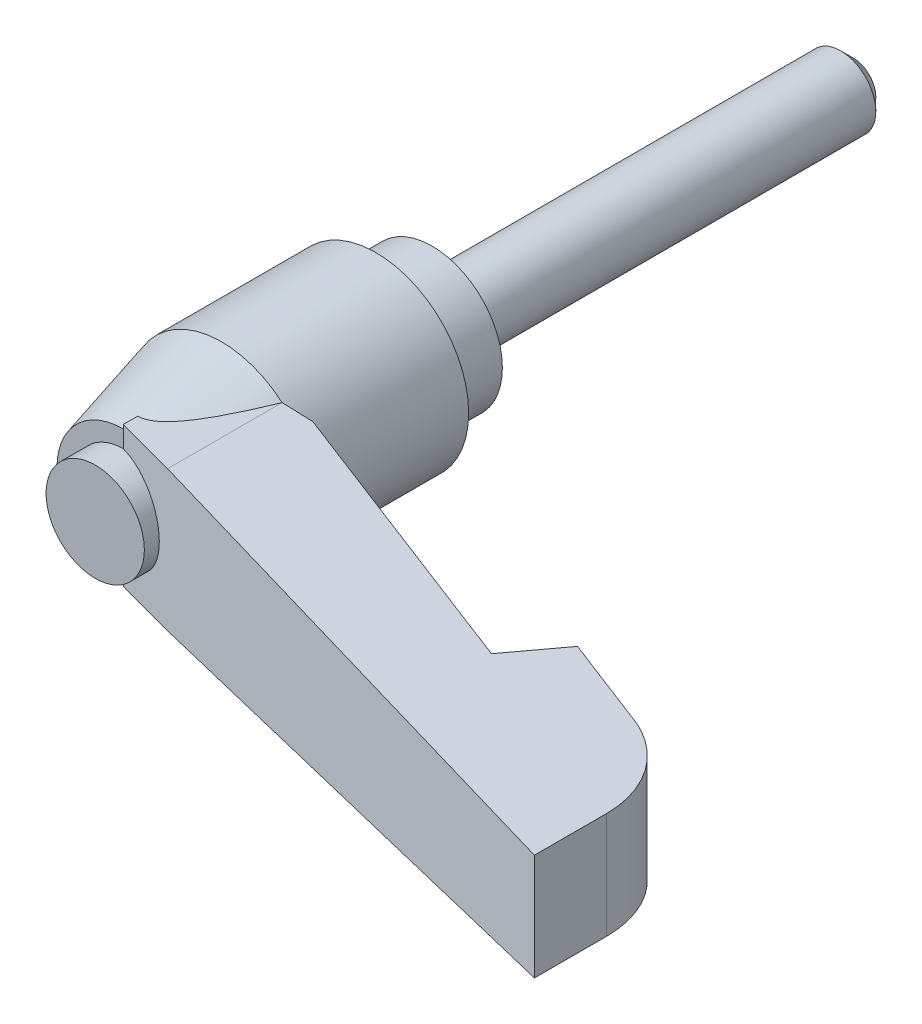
ISO-10303-21;
HEADER;
FILE_DESCRIPTION(('STEP AP214'),'2;1');
FILE_NAME('part.step','',(''),(''),'','','');
FILE_SCHEMA(('AUTOMOTIVE_DESIGN { 1 0 10303 214 1 1 1 1 }'));
ENDSEC;
DATA;
#1=APPLICATION_CONTEXT('core data for automotive mechanical design processes');
#2=APPLICATION_PROTOCOL_DEFINITION('international standard','automotive_design',2000,#1);
#3=PRODUCT_CONTEXT('',#1,'mechanical');
#4=PRODUCT('Part','Part','',(#3));
#5=PRODUCT_RELATED_PRODUCT_CATEGORY('part','',(#4));
#6=PRODUCT_DEFINITION_FORMATION('','',#4);
#7=PRODUCT_DEFINITION_CONTEXT('part definition',#1,'design');
#8=PRODUCT_DEFINITION('design','',#6,#7);
#9=PRODUCT_DEFINITION_SHAPE('','',#8);
#10=(LENGTH_UNIT() NAMED_UNIT(*) SI_UNIT(.MILLI.,.METRE.));
#11=(NAMED_UNIT(*) PLANE_ANGLE_UNIT() SI_UNIT($,.RADIAN.));
#12=(NAMED_UNIT(*) SI_UNIT($,.STERADIAN.) SOLID_ANGLE_UNIT());
#13=UNCERTAINTY_MEASURE_WITH_UNIT(LENGTH_MEASURE(1.E-05),#10,'distance_accuracy_value','');
#14=(GEOMETRIC_REPRESENTATION_CONTEXT(3) GLOBAL_UNCERTAINTY_ASSIGNED_CONTEXT((#13)) GLOBAL_UNIT_ASSIGNED_CONTEXT((#10,
#11,#12)) REPRESENTATION_CONTEXT('',''));
#15=CARTESIAN_POINT('',(0.,0.,0.));
#16=DIRECTION('',(0.,0.,1.));
#17=DIRECTION('',(1.,0.,0.));
#18=AXIS2_PLACEMENT_3D('',#15,#16,#17);
#19=CARTESIAN_POINT('',(2.53,-2.538705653,-30.));
#20=DIRECTION('',(0.,0.,-1.));
#21=DIRECTION('',(-1.,0.,0.));
#22=AXIS2_PLACEMENT_3D('',#19,#20,#21);
#23=PLANE('',#22);
#24=CARTESIAN_POINT('',(0.,0.,-30.));
#25=DIRECTION('',(0.,0.,-1.));
#26=DIRECTION('',(-1.,0.,0.));
#27=AXIS2_PLACEMENT_3D('',#24,#25,#26);
#28=CIRCLE('',#27,1.6);
#29=CARTESIAN_POINT('',(-1.6,0.,-30.));
#30=VERTEX_POINT('',#29);
#31=EDGE_CURVE('E9',#30,#30,#28,.T.);
#32=ORIENTED_EDGE('',*,*,#31,.T.);
#33=EDGE_LOOP('',(#32));
#34=FACE_BOUND('',#33,.T.);
#35=ADVANCED_FACE('F14',(#34),#23,.T.);
#36=CARTESIAN_POINT('',(0.,0.,-30.));
#37=DIRECTION('',(0.,0.,1.));
#38=DIRECTION('',(0.,-1.,0.));
#39=AXIS2_PLACEMENT_3D('',#36,#37,#38);
#40=CYLINDRICAL_SURFACE('',#39,2.5);
#41=CARTESIAN_POINT('',(0.,0.,-29.1));
#42=DIRECTION('',(0.,0.,-1.));
#43=DIRECTION('',(0.,1.,0.));
#44=AXIS2_PLACEMENT_3D('',#41,#42,#43);
#45=CIRCLE('',#44,2.5);
#46=CARTESIAN_POINT('',(0.,2.5,-29.1));
#47=VERTEX_POINT('',#46);
#48=EDGE_CURVE('E23',#47,#47,#45,.F.);
#49=ORIENTED_EDGE('',*,*,#48,.T.);
#50=EDGE_LOOP('',(#49));
#51=FACE_BOUND('',#50,.T.);
#52=CARTESIAN_POINT('',(0.,0.,0.));
#53=DIRECTION('',(0.,0.,1.));
#54=DIRECTION('',(0.,-1.,0.));
#55=AXIS2_PLACEMENT_3D('',#52,#53,#54);
#56=CIRCLE('',#55,2.5);
#57=CARTESIAN_POINT('',(0.,-2.50000000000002,0.));
#58=VERTEX_POINT('',#57);
#59=EDGE_CURVE('E143',#58,#58,#56,.F.);
#60=ORIENTED_EDGE('',*,*,#59,.T.);
#61=EDGE_LOOP('',(#60));
#62=FACE_BOUND('',#61,.T.);
#63=ADVANCED_FACE('F367',(#51,#62),#40,.T.);
#64=CARTESIAN_POINT('',(-5.06,-5.077411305,0.));
#65=DIRECTION('',(0.,0.,1.));
#66=DIRECTION('',(1.,0.,0.));
#67=AXIS2_PLACEMENT_3D('',#64,#65,#66);
#68=PLANE('',#67);
#69=ORIENTED_EDGE('',*,*,#59,.F.);
#70=EDGE_LOOP('',(#69));
#71=FACE_BOUND('',#70,.T.);
#72=CARTESIAN_POINT('',(0.,0.,0.));
#73=DIRECTION('',(0.,0.,1.));
#74=DIRECTION('',(1.,0.,0.));
#75=AXIS2_PLACEMENT_3D('',#72,#73,#74);
#76=CIRCLE('',#75,5.);
#77=CARTESIAN_POINT('',(5.,0.,0.));
#78=VERTEX_POINT('',#77);
#79=EDGE_CURVE('E122',#78,#78,#76,.T.);
#80=ORIENTED_EDGE('',*,*,#79,.F.);
#81=EDGE_LOOP('',(#80));
#82=FACE_BOUND('',#81,.T.);
#83=ADVANCED_FACE('F369',(#71,#82),#68,.F.);
#84=CARTESIAN_POINT('',(-3.542,-3.554187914,24.));
#85=DIRECTION('',(0.,0.,1.));
#86=DIRECTION('',(1.,0.,0.));
#87=AXIS2_PLACEMENT_3D('',#84,#85,#86);
#88=PLANE('',#87);
#89=CARTESIAN_POINT('',(0.,0.,24.));
#90=DIRECTION('',(0.,0.,1.));
#91=DIRECTION('',(1.,0.,0.));
#92=AXIS2_PLACEMENT_3D('',#89,#90,#91);
#93=CIRCLE('',#92,3.5);
#94=CARTESIAN_POINT('',(3.5,0.,24.));
#95=VERTEX_POINT('',#94);
#96=EDGE_CURVE('E208',#95,#95,#93,.F.);
#97=ORIENTED_EDGE('',*,*,#96,.F.);
#98=EDGE_LOOP('',(#97));
#99=FACE_BOUND('',#98,.T.);
#100=ADVANCED_FACE('F365',(#99),#88,.T.);
#101=CARTESIAN_POINT('',(0.,0.,0.));
#102=DIRECTION('',(0.,0.,1.));
#103=DIRECTION('',(1.,0.,0.));
#104=AXIS2_PLACEMENT_3D('',#101,#102,#103);
#105=CYLINDRICAL_SURFACE('',#104,5.);
#106=CARTESIAN_POINT('',(0.,0.,4.));
#107=DIRECTION('',(0.,0.,1.));
#108=DIRECTION('',(1.,0.,0.));
#109=AXIS2_PLACEMENT_3D('',#106,#107,#108);
#110=CIRCLE('',#109,5.);
#111=CARTESIAN_POINT('',(5.,0.,4.));
#112=VERTEX_POINT('',#111);
#113=EDGE_CURVE('E273',#112,#112,#110,.F.);
#114=ORIENTED_EDGE('',*,*,#113,.T.);
#115=EDGE_LOOP('',(#114));
#116=FACE_BOUND('',#115,.T.);
#117=ORIENTED_EDGE('',*,*,#79,.T.);
#118=EDGE_LOOP('',(#117));
#119=FACE_BOUND('',#118,.T.);
#120=ADVANCED_FACE('F362',(#116,#119),#105,.T.);
#121=CARTESIAN_POINT('',(6.5,1.121419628,15.));
#122=DIRECTION('',(0.,0.,-1.));
#123=DIRECTION('',(-1.,0.,0.));
#124=AXIS2_PLACEMENT_3D('',#121,#122,#123);
#125=PLANE('',#124);
#126=DIRECTION('',(-0.999423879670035,0.0339397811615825,0.));
#127=VECTOR('',#126,1.);
#128=CARTESIAN_POINT('',(22.154065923,4.393963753,15.));
#129=LINE('',#128,#127);
#130=CARTESIAN_POINT('',(6.4999999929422,4.9255655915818,15.));
#131=VERTEX_POINT('',#130);
#132=CARTESIAN_POINT('',(4.30813184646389,4.99999999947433,15.0000000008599));
#133=VERTEX_POINT('',#132);
#134=EDGE_CURVE('E206',#131,#133,#129,.T.);
#135=ORIENTED_EDGE('',*,*,#134,.F.);
#136=DIRECTION('',(0.,1.,0.));
#137=VECTOR('',#136,1.);
#138=CARTESIAN_POINT('',(6.5,0.,15.));
#139=LINE('',#138,#137);
#140=CARTESIAN_POINT('',(6.5,1.14455231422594,15.));
#141=VERTEX_POINT('',#140);
#142=EDGE_CURVE('E203',#141,#131,#139,.T.);
#143=ORIENTED_EDGE('',*,*,#142,.F.);
#144=CARTESIAN_POINT('',(0.,0.,15.));
#145=DIRECTION('',(0.,0.,1.));
#146=DIRECTION('',(1.,0.,0.));
#147=AXIS2_PLACEMENT_3D('',#144,#145,#146);
#148=CIRCLE('',#147,6.6);
#149=EDGE_CURVE('E284',#133,#141,#148,.F.);
#150=ORIENTED_EDGE('',*,*,#149,.F.);
#151=EDGE_LOOP('',(#135,#143,#150));
#152=FACE_BOUND('',#151,.T.);
#153=ADVANCED_FACE('F283',(#152),#125,.T.);
#154=CARTESIAN_POINT('',(33.,3.991671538,27.571700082));
#155=DIRECTION('',(0.,-1.,0.));
#156=DIRECTION('',(0.,0.,-1.));
#157=AXIS2_PLACEMENT_3D('',#154,#155,#156);
#158=CYLINDRICAL_SURFACE('',#157,7.);
#159=CARTESIAN_POINT('',(33.,4.02564292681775,27.571700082));
#160=DIRECTION('',(0.0339397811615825,0.999423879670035,0.));
#161=DIRECTION('',(0.999423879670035,-0.0339397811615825,0.));
#162=AXIS2_PLACEMENT_3D('',#159,#160,#161);
#163=ELLIPSE('',#162,7.00403516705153,7.);
#164=CARTESIAN_POINT('',(40.,3.787927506,27.571700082));
#165=VERTEX_POINT('',#164);
#166=CARTESIAN_POINT('',(35.3941410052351,3.94433946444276,20.9938517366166));
#167=VERTEX_POINT('',#166);
#168=EDGE_CURVE('E115',#165,#167,#163,.T.);
#169=ORIENTED_EDGE('',*,*,#168,.F.);
#170=DIRECTION('',(0.,-1.,0.));
#171=VECTOR('',#170,1.);
#172=CARTESIAN_POINT('',(40.,0.,27.571700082));
#173=LINE('',#172,#171);
#174=CARTESIAN_POINT('',(40.,-3.787927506,27.571700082));
#175=VERTEX_POINT('',#174);
#176=EDGE_CURVE('E106',#165,#175,#173,.T.);
#177=ORIENTED_EDGE('',*,*,#176,.T.);
#178=CARTESIAN_POINT('',(33.,-4.02564292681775,27.571700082));
#179=DIRECTION('',(-0.0339397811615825,0.999423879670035,0.));
#180=DIRECTION('',(-0.999423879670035,-0.0339397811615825,0.));
#181=AXIS2_PLACEMENT_3D('',#178,#179,#180);
#182=ELLIPSE('',#181,7.00403516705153,7.);
#183=CARTESIAN_POINT('',(35.3941410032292,-3.94433946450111,20.9938517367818));
#184=VERTEX_POINT('',#183);
#185=EDGE_CURVE('E118',#175,#184,#182,.T.);
#186=ORIENTED_EDGE('',*,*,#185,.T.);
#187=DIRECTION('',(0.,-1.,0.));
#188=VECTOR('',#187,1.);
#189=CARTESIAN_POINT('',(35.394141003,0.,20.993851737));
#190=LINE('',#189,#188);
#191=EDGE_CURVE('E111',#167,#184,#190,.T.);
#192=ORIENTED_EDGE('',*,*,#191,.F.);
#193=EDGE_LOOP('',(#169,#177,#186,#192));
#194=FACE_BOUND('',#193,.T.);
#195=ADVANCED_FACE('F113',(#194),#158,.T.);
#196=CARTESIAN_POINT('',(35.394141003,-4.210603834,20.993851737));
#197=DIRECTION('',(0.342020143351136,0.,-0.939692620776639));
#198=DIRECTION('',(-0.939692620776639,0.,-0.342020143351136));
#199=AXIS2_PLACEMENT_3D('',#196,#197,#198);
#200=PLANE('',#199);
#201=DIRECTION('',(-0.939214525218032,0.0318951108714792,-0.341846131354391));
#202=VECTOR('',#201,1.);
#203=CARTESIAN_POINT('',(35.3941410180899,3.944339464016,20.9938517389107));
#204=LINE('',#203,#202);
#205=CARTESIAN_POINT('',(29.0236925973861,4.16067572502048,18.67519813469));
#206=VERTEX_POINT('',#205);
#207=EDGE_CURVE('E125',#167,#206,#204,.T.);
#208=ORIENTED_EDGE('',*,*,#207,.F.);
#209=ORIENTED_EDGE('',*,*,#191,.T.);
#210=DIRECTION('',(-0.939214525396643,-0.0318951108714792,-0.341846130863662));
#211=VECTOR('',#210,1.);
#212=CARTESIAN_POINT('',(35.3941410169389,-3.944339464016,20.9938517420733));
#213=LINE('',#212,#211);
#214=CARTESIAN_POINT('',(29.023692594,-4.16067572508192,18.675198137));
#215=VERTEX_POINT('',#214);
#216=EDGE_CURVE('E300',#184,#215,#213,.T.);
#217=ORIENTED_EDGE('',*,*,#216,.T.);
#218=DIRECTION('',(0.,-1.,0.));
#219=VECTOR('',#218,1.);
#220=CARTESIAN_POINT('',(29.023692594,0.,18.675198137));
#221=LINE('',#220,#219);
#222=EDGE_CURVE('E121',#206,#215,#221,.T.);
#223=ORIENTED_EDGE('',*,*,#222,.F.);
#224=EDGE_LOOP('',(#208,#209,#217,#223));
#225=FACE_BOUND('',#224,.T.);
#226=ADVANCED_FACE('F126',(#225),#200,.T.);
#227=CARTESIAN_POINT('',(29.023692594,-4.297335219,18.675198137));
#228=DIRECTION('',(-0.819152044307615,0.,-0.57357643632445));
#229=DIRECTION('',(-0.57357643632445,0.,0.819152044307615));
#230=AXIS2_PLACEMENT_3D('',#227,#228,#229);
#231=PLANE('',#230);
#232=DIRECTION('',(-0.573467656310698,0.0194745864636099,0.818996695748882));
#233=VECTOR('',#232,1.);
#234=CARTESIAN_POINT('',(29.0236925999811,4.16067572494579,18.675198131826));
#235=LINE('',#234,#233);
#236=CARTESIAN_POINT('',(26.5000000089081,4.2463786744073,22.2794046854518));
#237=VERTEX_POINT('',#236);
#238=EDGE_CURVE('E131',#206,#237,#235,.T.);
#239=ORIENTED_EDGE('',*,*,#238,.F.);
#240=ORIENTED_EDGE('',*,*,#222,.T.);
#241=DIRECTION('',(-0.573467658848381,-0.0194745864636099,0.818996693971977));
#242=VECTOR('',#241,1.);
#243=CARTESIAN_POINT('',(29.0236925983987,-4.16067572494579,18.675198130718));
#244=LINE('',#243,#242);
#245=CARTESIAN_POINT('',(26.5,-4.24637867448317,22.279404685));
#246=VERTEX_POINT('',#245);
#247=EDGE_CURVE('E302',#215,#246,#244,.T.);
#248=ORIENTED_EDGE('',*,*,#247,.T.);
#249=DIRECTION('',(0.,-1.,0.));
#250=VECTOR('',#249,1.);
#251=CARTESIAN_POINT('',(26.5,0.,22.279404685));
#252=LINE('',#251,#250);
#253=EDGE_CURVE('E200',#237,#246,#252,.T.);
#254=ORIENTED_EDGE('',*,*,#253,.F.);
#255=EDGE_LOOP('',(#239,#240,#248,#254));
#256=FACE_BOUND('',#255,.T.);
#257=ADVANCED_FACE('F507',(#256),#231,.T.);
#258=CARTESIAN_POINT('',(26.5,-4.984672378,22.279404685));
#259=DIRECTION('',(0.342020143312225,0.,-0.939692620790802));
#260=DIRECTION('',(-0.939692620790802,0.,-0.342020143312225));
#261=AXIS2_PLACEMENT_3D('',#258,#259,#260);
#262=PLANE('',#261);
#263=DIRECTION('',(-0.939214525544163,0.0318951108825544,-0.341846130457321));
#264=VECTOR('',#263,1.);
#265=CARTESIAN_POINT('',(26.5000000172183,4.24637867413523,22.2794046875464));
#266=LINE('',#265,#264);
#267=EDGE_CURVE('E209',#237,#131,#266,.T.);
#268=ORIENTED_EDGE('',*,*,#267,.F.);
#269=ORIENTED_EDGE('',*,*,#253,.T.);
#270=DIRECTION('',(-0.939214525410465,-0.0318951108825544,-0.34184613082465));
#271=VECTOR('',#270,1.);
#272=CARTESIAN_POINT('',(26.5000000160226,-4.24637867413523,22.2794046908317));
#273=LINE('',#272,#271);
#274=CARTESIAN_POINT('',(6.5,-4.92556559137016,15.));
#275=VERTEX_POINT('',#274);
#276=EDGE_CURVE('E172',#246,#275,#273,.T.);
#277=ORIENTED_EDGE('',*,*,#276,.T.);
#278=DIRECTION('',(0.,-1.,0.));
#279=VECTOR('',#278,1.);
#280=CARTESIAN_POINT('',(6.5,-3.072276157,15.));
#281=LINE('',#280,#279);
#282=CARTESIAN_POINT('',(6.50000000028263,-1.1445523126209,15.));
#283=VERTEX_POINT('',#282);
#284=EDGE_CURVE('E265',#283,#275,#281,.T.);
#285=ORIENTED_EDGE('',*,*,#284,.F.);
#286=CARTESIAN_POINT('',(-0.712266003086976,0.,12.3749498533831));
#287=DIRECTION('',(0.342020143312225,0.,-0.939692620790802));
#288=DIRECTION('',(-0.939692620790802,0.,-0.342020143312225));
#289=AXIS2_PLACEMENT_3D('',#286,#287,#288);
#290=ELLIPSE('',#289,7.77209472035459,7.26856501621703);
#291=CARTESIAN_POINT('',(6.59542722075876,-3.94812923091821E-10,15.0145038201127));
#292=VERTEX_POINT('',#291);
#293=EDGE_CURVE('E31',#292,#283,#290,.T.);
#294=ORIENTED_EDGE('',*,*,#293,.F.);
#295=CARTESIAN_POINT('',(0.,0.,12.634193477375));
#296=DIRECTION('',(0.342020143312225,0.,-0.939692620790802));
#297=DIRECTION('',(0.939692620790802,0.,0.342020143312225));
#298=AXIS2_PLACEMENT_3D('',#295,#296,#297);
#299=ELLIPSE('',#298,7.02357329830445,6.6);
#300=EDGE_CURVE('E279',#141,#292,#299,.T.);
#301=ORIENTED_EDGE('',*,*,#300,.F.);
#302=ORIENTED_EDGE('',*,*,#142,.T.);
#303=EDGE_LOOP('',(#268,#269,#277,#285,#294,#301,#302));
#304=FACE_BOUND('',#303,.T.);
#305=ADVANCED_FACE('F277',(#304),#262,.T.);
#306=CARTESIAN_POINT('',(40.,-3.787927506,27.571700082));
#307=DIRECTION('',(-1.,0.,0.));
#308=DIRECTION('',(0.,0.,1.));
#309=AXIS2_PLACEMENT_3D('',#306,#307,#308);
#310=PLANE('',#309);
#311=DIRECTION('',(0.,0.,-1.));
#312=VECTOR('',#311,1.);
#313=CARTESIAN_POINT('',(40.,-3.787927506,23.9121377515));
#314=LINE('',#313,#312);
#315=CARTESIAN_POINT('',(40.,-3.787927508,32.717967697));
#316=VERTEX_POINT('',#315);
#317=EDGE_CURVE('E263',#316,#175,#314,.T.);
#318=ORIENTED_EDGE('',*,*,#317,.T.);
#319=ORIENTED_EDGE('',*,*,#176,.F.);
#320=DIRECTION('',(0.,0.,-1.));
#321=VECTOR('',#320,1.);
#322=CARTESIAN_POINT('',(40.,3.787927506,23.9121377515));
#323=LINE('',#322,#321);
#324=CARTESIAN_POINT('',(40.,3.787927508,32.717967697));
#325=VERTEX_POINT('',#324);
#326=EDGE_CURVE('E136',#325,#165,#323,.T.);
#327=ORIENTED_EDGE('',*,*,#326,.F.);
#328=DIRECTION('',(0.,1.,0.));
#329=VECTOR('',#328,1.);
#330=CARTESIAN_POINT('',(40.,0.,32.717967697));
#331=LINE('',#330,#329);
#332=EDGE_CURVE('E197',#316,#325,#331,.T.);
#333=ORIENTED_EDGE('',*,*,#332,.F.);
#334=EDGE_LOOP('',(#318,#319,#327,#333));
#335=FACE_BOUND('',#334,.T.);
#336=ADVANCED_FACE('F525',(#335),#310,.F.);
#337=CARTESIAN_POINT('',(40.,3.787927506,15.));
#338=DIRECTION('',(0.0339397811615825,0.999423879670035,0.));
#339=DIRECTION('',(-0.999423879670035,0.0339397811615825,0.));
#340=AXIS2_PLACEMENT_3D('',#337,#338,#339);
#341=PLANE('',#340);
#342=ORIENTED_EDGE('',*,*,#267,.T.);
#343=ORIENTED_EDGE('',*,*,#134,.T.);
#344=DIRECTION('',(0.,0.,1.));
#345=VECTOR('',#344,1.);
#346=CARTESIAN_POINT('',(4.308131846,5.,19.0771802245));
#347=LINE('',#346,#345);
#348=CARTESIAN_POINT('',(4.30813184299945,5.,23.1543604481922));
#349=VERTEX_POINT('',#348);
#350=EDGE_CURVE('E272',#133,#349,#347,.T.);
#351=ORIENTED_EDGE('',*,*,#350,.T.);
#352=DIRECTION('',(-0.965406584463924,0.0327845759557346,-0.258679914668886));
#353=VECTOR('',#352,1.);
#354=CARTESIAN_POINT('',(40.,3.78792751,32.717967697));
#355=LINE('',#354,#353);
#356=EDGE_CURVE('E194',#325,#349,#355,.T.);
#357=ORIENTED_EDGE('',*,*,#356,.F.);
#358=ORIENTED_EDGE('',*,*,#326,.T.);
#359=ORIENTED_EDGE('',*,*,#168,.T.);
#360=ORIENTED_EDGE('',*,*,#207,.T.);
#361=ORIENTED_EDGE('',*,*,#238,.T.);
#362=EDGE_LOOP('',(#342,#343,#351,#357,#358,#359,#360,#361));
#363=FACE_BOUND('',#362,.T.);
#364=ADVANCED_FACE('F134',(#363),#341,.T.);
#365=CARTESIAN_POINT('',(0.,0.,22.));
#366=DIRECTION('',(0.,0.,1.));
#367=DIRECTION('',(1.,0.,0.));
#368=AXIS2_PLACEMENT_3D('',#365,#366,#367);
#369=CYLINDRICAL_SURFACE('',#368,3.5);
#370=CARTESIAN_POINT('',(0.,0.,22.));
#371=DIRECTION('',(-0.258819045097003,0.,0.965925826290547));
#372=DIRECTION('',(0.965925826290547,0.,0.258819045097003));
#373=AXIS2_PLACEMENT_3D('',#370,#371,#372);
#374=ELLIPSE('',#373,3.62346663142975,3.5);
#375=CARTESIAN_POINT('',(0.,3.5,22.));
#376=VERTEX_POINT('',#375);
#377=CARTESIAN_POINT('',(0.,-3.5,22.));
#378=VERTEX_POINT('',#377);
#379=EDGE_CURVE('E188',#376,#378,#374,.F.);
#380=ORIENTED_EDGE('',*,*,#379,.F.);
#381=CARTESIAN_POINT('',(0.,0.,22.));
#382=DIRECTION('',(0.,0.,1.));
#383=DIRECTION('',(1.,0.,0.));
#384=AXIS2_PLACEMENT_3D('',#381,#382,#383);
#385=CIRCLE('',#384,3.5);
#386=EDGE_CURVE('E254',#376,#378,#385,.T.);
#387=ORIENTED_EDGE('',*,*,#386,.T.);
#388=EDGE_LOOP('',(#380,#387));
#389=FACE_BOUND('',#388,.T.);
#390=ORIENTED_EDGE('',*,*,#96,.T.);
#391=EDGE_LOOP('',(#390));
#392=FACE_BOUND('',#391,.T.);
#393=ADVANCED_FACE('F356',(#389,#392),#369,.T.);
#394=CARTESIAN_POINT('',(0.,4.722701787,20.96510898));
#395=DIRECTION('',(-1.,0.,0.));
#396=DIRECTION('',(0.,0.,1.));
#397=AXIS2_PLACEMENT_3D('',#394,#395,#396);
#398=PLANE('',#397);
#399=DIRECTION('',(0.,-1.,0.));
#400=VECTOR('',#399,1.);
#401=CARTESIAN_POINT('',(0.,0.,22.));
#402=LINE('',#401,#400);
#403=CARTESIAN_POINT('',(0.,5.,22.00000000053));
#404=VERTEX_POINT('',#403);
#405=CARTESIAN_POINT('',(4.8449077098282E-10,4.7243556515,22.));
#406=VERTEX_POINT('',#405);
#407=EDGE_CURVE('E185',#404,#406,#402,.T.);
#408=ORIENTED_EDGE('',*,*,#407,.F.);
#409=DIRECTION('',(0.,0.,-1.));
#410=VECTOR('',#409,1.);
#411=CARTESIAN_POINT('',(0.,5.,19.0771802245));
#412=LINE('',#411,#410);
#413=CARTESIAN_POINT('',(2.56379285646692E-10,5.,20.9712812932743));
#414=VERTEX_POINT('',#413);
#415=EDGE_CURVE('E270',#404,#414,#412,.T.);
#416=ORIENTED_EDGE('',*,*,#415,.T.);
#417=DIRECTION('',(5.3084673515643E-11,0.258819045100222,-0.965925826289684));
#418=VECTOR('',#417,1.);
#419=CARTESIAN_POINT('',(1.16133208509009E-09,5.6621778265,18.5));
#420=LINE('',#419,#418);
#421=EDGE_CURVE('E180',#406,#414,#420,.T.);
#422=ORIENTED_EDGE('',*,*,#421,.F.);
#423=EDGE_LOOP('',(#408,#416,#422));
#424=FACE_BOUND('',#423,.T.);
#425=ADVANCED_FACE('F323',(#424),#398,.T.);
#426=CARTESIAN_POINT('',(0.,5.,23.203286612));
#427=DIRECTION('',(0.,-1.,0.));
#428=DIRECTION('',(0.,0.,-1.));
#429=AXIS2_PLACEMENT_3D('',#426,#427,#428);
#430=PLANE('',#429);
#431=ORIENTED_EDGE('',*,*,#350,.F.);
#432=CARTESIAN_POINT('',(5.12758570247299E-10,4.99999999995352,20.9712812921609));
#433=CARTESIAN_POINT('',(0.0452169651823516,4.99999999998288,20.9713050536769));
#434=CARTESIAN_POINT('',(0.0904012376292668,4.99999999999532,20.9689904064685));
#435=CARTESIAN_POINT('',(0.180236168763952,5.00000000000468,20.9599070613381));
#436=CARTESIAN_POINT('',(0.224887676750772,5.00000000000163,20.9531468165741));
#437=CARTESIAN_POINT('',(0.355879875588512,4.9999999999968,20.9268621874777));
#438=CARTESIAN_POINT('',(0.441043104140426,4.99999999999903,20.9013147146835));
#439=CARTESIAN_POINT('',(0.632227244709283,5.00000000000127,20.8270446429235));
#440=CARTESIAN_POINT('',(0.736330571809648,5.00000000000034,20.7735488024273));
#441=CARTESIAN_POINT('',(0.935669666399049,4.99999999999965,20.6509465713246));
#442=CARTESIAN_POINT('',(1.03082413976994,4.9999999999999,20.5817135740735));
#443=CARTESIAN_POINT('',(1.23366330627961,5.00000000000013,20.4160087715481));
#444=CARTESIAN_POINT('',(1.33918187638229,5.00000000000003,20.3169366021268));
#445=CARTESIAN_POINT('',(1.54038525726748,4.99999999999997,20.1091453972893));
#446=CARTESIAN_POINT('',(1.63605047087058,4.99999999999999,20.0004079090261));
#447=CARTESIAN_POINT('',(1.82048892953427,5.00000000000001,19.7755785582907));
#448=CARTESIAN_POINT('',(1.9091882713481,5.,19.6594267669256));
#449=CARTESIAN_POINT('',(2.08029219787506,5.,19.4227906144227));
#450=CARTESIAN_POINT('',(2.16270259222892,5.,19.302310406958));
#451=CARTESIAN_POINT('',(2.35274250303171,5.,19.0120714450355));
#452=CARTESIAN_POINT('',(2.4581571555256,5.,18.8408691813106));
#453=CARTESIAN_POINT('',(2.66191601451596,5.,18.494284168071));
#454=CARTESIAN_POINT('',(2.76025796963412,5.,18.3189001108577));
#455=CARTESIAN_POINT('',(2.95155424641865,5.,17.9648132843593));
#456=CARTESIAN_POINT('',(3.04449826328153,5.,17.7861049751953));
#457=CARTESIAN_POINT('',(3.22591068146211,5.,17.4264286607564));
#458=CARTESIAN_POINT('',(3.31437881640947,5.,17.2454605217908));
#459=CARTESIAN_POINT('',(3.48198701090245,5.,16.8936485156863));
#460=CARTESIAN_POINT('',(3.56135902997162,5.,16.7229147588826));
#461=CARTESIAN_POINT('',(3.71739787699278,5.,16.3802085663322));
#462=CARTESIAN_POINT('',(3.79406458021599,5.,16.2082360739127));
#463=CARTESIAN_POINT('',(3.94476452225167,5.,15.8640185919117));
#464=CARTESIAN_POINT('',(4.01880761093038,5.,15.6917779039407));
#465=CARTESIAN_POINT('',(4.16489312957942,5.,15.3464724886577));
#466=CARTESIAN_POINT('',(4.23693578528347,5.,15.1734078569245));
#467=CARTESIAN_POINT('',(4.3081318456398,5.,15.0000000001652));
#468=B_SPLINE_CURVE_WITH_KNOTS('',3,(#432,#433,#434,#435,#436,#437,#438,#439,#440,#441,#442,
#443,#444,#445,#446,#447,#448,#449,#450,#451,#452,#453,#454,#455,#456,#457,#458,#459,#460,#461,
#462,#463,#464,#465,#466,#467),.UNSPECIFIED.,.F.,.F.,(4,2,2,2,2,2,2,2,2,2,2,2,2,2,2,2,2,4),(0.,
0.135533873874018,0.270810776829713,0.536101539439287,0.885260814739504,1.23733529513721,
1.67054898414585,2.10460829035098,2.54278097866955,2.98054386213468,3.58345671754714,
4.18656065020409,4.79078044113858,5.39503614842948,5.95985360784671,6.52469707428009,
7.08712785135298,7.6494949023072),.UNSPECIFIED.);
#469=EDGE_CURVE('E183',#414,#133,#468,.T.);
#470=ORIENTED_EDGE('',*,*,#469,.F.);
#471=ORIENTED_EDGE('',*,*,#415,.F.);
#472=DIRECTION('',(-0.965925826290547,0.,-0.258819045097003));
#473=VECTOR('',#472,1.);
#474=CARTESIAN_POINT('',(20.,5.,27.3589838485));
#475=LINE('',#474,#473);
#476=EDGE_CURVE('E189',#349,#404,#475,.T.);
#477=ORIENTED_EDGE('',*,*,#476,.F.);
#478=EDGE_LOOP('',(#431,#470,#471,#477));
#479=FACE_BOUND('',#478,.T.);
#480=ADVANCED_FACE('F317',(#479),#430,.F.);
#481=CARTESIAN_POINT('',(-6.6792,-6.702182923,4.));
#482=DIRECTION('',(0.,0.,1.));
#483=DIRECTION('',(1.,0.,0.));
#484=AXIS2_PLACEMENT_3D('',#481,#482,#483);
#485=PLANE('',#484);
#486=ORIENTED_EDGE('',*,*,#113,.F.);
#487=EDGE_LOOP('',(#486));
#488=FACE_BOUND('',#487,.T.);
#489=CARTESIAN_POINT('',(0.,0.,4.));
#490=DIRECTION('',(0.,0.,1.));
#491=DIRECTION('',(1.,0.,0.));
#492=AXIS2_PLACEMENT_3D('',#489,#490,#491);
#493=CIRCLE('',#492,6.6);
#494=CARTESIAN_POINT('',(6.6,0.,4.));
#495=VERTEX_POINT('',#494);
#496=EDGE_CURVE('E177',#495,#495,#493,.T.);
#497=ORIENTED_EDGE('',*,*,#496,.F.);
#498=EDGE_LOOP('',(#497));
#499=FACE_BOUND('',#498,.T.);
#500=ADVANCED_FACE('F322',(#488,#499),#485,.F.);
#501=CARTESIAN_POINT('',(0.,0.,15.022195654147));
#502=DIRECTION('',(0.,0.,-1.));
#503=DIRECTION('',(-1.,0.,0.));
#504=AXIS2_PLACEMENT_3D('',#501,#502,#503);
#505=CONICAL_SURFACE('',#504,6.594052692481,0.261799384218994);
#506=CARTESIAN_POINT('',(0.,0.,15.));
#507=DIRECTION('',(0.,0.,1.));
#508=DIRECTION('',(1.,0.,0.));
#509=AXIS2_PLACEMENT_3D('',#506,#507,#508);
#510=CIRCLE('',#509,6.6);
#511=EDGE_CURVE('E173',#292,#283,#510,.F.);
#512=ORIENTED_EDGE('',*,*,#511,.F.);
#513=ORIENTED_EDGE('',*,*,#293,.T.);
#514=EDGE_LOOP('',(#512,#513));
#515=FACE_BOUND('',#514,.T.);
#516=ADVANCED_FACE('F328',(#515),#505,.T.);
#517=CARTESIAN_POINT('',(6.5,-5.023132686,15.));
#518=DIRECTION('',(0.,0.,-1.));
#519=DIRECTION('',(-1.,0.,0.));
#520=AXIS2_PLACEMENT_3D('',#517,#518,#519);
#521=PLANE('',#520);
#522=CARTESIAN_POINT('',(0.,0.,15.));
#523=DIRECTION('',(0.,0.,1.));
#524=DIRECTION('',(1.,0.,0.));
#525=AXIS2_PLACEMENT_3D('',#522,#523,#524);
#526=CIRCLE('',#525,6.6);
#527=CARTESIAN_POINT('',(4.30813184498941,-5.00000000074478,14.9999999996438));
#528=VERTEX_POINT('',#527);
#529=EDGE_CURVE('E176',#283,#528,#526,.F.);
#530=ORIENTED_EDGE('',*,*,#529,.F.);
#531=ORIENTED_EDGE('',*,*,#284,.T.);
#532=DIRECTION('',(-0.999423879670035,-0.0339397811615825,0.));
#533=VECTOR('',#532,1.);
#534=CARTESIAN_POINT('',(22.154065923,-4.393963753,15.));
#535=LINE('',#534,#533);
#536=EDGE_CURVE('E169',#275,#528,#535,.T.);
#537=ORIENTED_EDGE('',*,*,#536,.T.);
#538=EDGE_LOOP('',(#530,#531,#537));
#539=FACE_BOUND('',#538,.T.);
#540=ADVANCED_FACE('F330',(#539),#521,.T.);
#541=CARTESIAN_POINT('',(40.,-3.787927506,15.));
#542=DIRECTION('',(-0.0339397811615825,0.999423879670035,0.));
#543=DIRECTION('',(-0.999423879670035,-0.0339397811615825,0.));
#544=AXIS2_PLACEMENT_3D('',#541,#542,#543);
#545=PLANE('',#544);
#546=DIRECTION('',(0.,0.,1.));
#547=VECTOR('',#546,1.);
#548=CARTESIAN_POINT('',(4.308131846,-5.,19.0771802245));
#549=LINE('',#548,#547);
#550=CARTESIAN_POINT('',(4.30813184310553,-4.99999999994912,23.1543604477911));
#551=VERTEX_POINT('',#550);
#552=EDGE_CURVE('E244',#528,#551,#549,.T.);
#553=ORIENTED_EDGE('',*,*,#552,.F.);
#554=ORIENTED_EDGE('',*,*,#536,.F.);
#555=ORIENTED_EDGE('',*,*,#276,.F.);
#556=ORIENTED_EDGE('',*,*,#247,.F.);
#557=ORIENTED_EDGE('',*,*,#216,.F.);
#558=ORIENTED_EDGE('',*,*,#185,.F.);
#559=ORIENTED_EDGE('',*,*,#317,.F.);
#560=DIRECTION('',(0.965406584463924,0.0327845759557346,0.258679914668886));
#561=VECTOR('',#560,1.);
#562=CARTESIAN_POINT('',(4.30813184,-5.,23.1543604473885));
#563=LINE('',#562,#561);
#564=EDGE_CURVE('E171',#551,#316,#563,.T.);
#565=ORIENTED_EDGE('',*,*,#564,.F.);
#566=EDGE_LOOP('',(#553,#554,#555,#556,#557,#558,#559,#565));
#567=FACE_BOUND('',#566,.T.);
#568=ADVANCED_FACE('F333',(#567),#545,.F.);
#569=CARTESIAN_POINT('',(0.,-5.,22.));
#570=DIRECTION('',(-0.258819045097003,0.,0.965925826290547));
#571=DIRECTION('',(0.965925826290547,0.,0.258819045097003));
#572=AXIS2_PLACEMENT_3D('',#569,#570,#571);
#573=PLANE('',#572);
#574=DIRECTION('',(0.,1.,0.));
#575=VECTOR('',#574,1.);
#576=CARTESIAN_POINT('',(0.,-4.8613508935,22.));
#577=LINE('',#576,#575);
#578=CARTESIAN_POINT('',(0.,-5.,22.0000000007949));
#579=VERTEX_POINT('',#578);
#580=CARTESIAN_POINT('',(9.0870570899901E-10,-4.72435565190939,22.));
#581=VERTEX_POINT('',#580);
#582=EDGE_CURVE('E164',#579,#581,#577,.T.);
#583=ORIENTED_EDGE('',*,*,#582,.F.);
#584=DIRECTION('',(-0.965925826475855,0.,-0.258819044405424));
#585=VECTOR('',#584,1.);
#586=CARTESIAN_POINT('',(4.308131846,-5.,23.1543604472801));
#587=LINE('',#586,#585);
#588=EDGE_CURVE('E165',#551,#579,#587,.T.);
#589=ORIENTED_EDGE('',*,*,#588,.F.);
#590=ORIENTED_EDGE('',*,*,#564,.T.);
#591=ORIENTED_EDGE('',*,*,#332,.T.);
#592=ORIENTED_EDGE('',*,*,#356,.T.);
#593=ORIENTED_EDGE('',*,*,#476,.T.);
#594=ORIENTED_EDGE('',*,*,#407,.T.);
#595=DIRECTION('',(0.,-1.,0.));
#596=VECTOR('',#595,1.);
#597=CARTESIAN_POINT('',(0.,0.,22.));
#598=LINE('',#597,#596);
#599=EDGE_CURVE('E257',#406,#376,#598,.T.);
#600=ORIENTED_EDGE('',*,*,#599,.T.);
#601=ORIENTED_EDGE('',*,*,#379,.T.);
#602=DIRECTION('',(0.,-1.,0.));
#603=VECTOR('',#602,1.);
#604=CARTESIAN_POINT('',(0.,0.,22.));
#605=LINE('',#604,#603);
#606=EDGE_CURVE('E184',#378,#581,#605,.T.);
#607=ORIENTED_EDGE('',*,*,#606,.T.);
#608=EDGE_LOOP('',(#583,#589,#590,#591,#592,#593,#594,#600,#601,#607));
#609=FACE_BOUND('',#608,.T.);
#610=ADVANCED_FACE('F247',(#609),#573,.T.);
#611=CARTESIAN_POINT('',(0.,-4.781047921,22.));
#612=DIRECTION('',(0.,0.,-1.));
#613=DIRECTION('',(-1.,0.,0.));
#614=AXIS2_PLACEMENT_3D('',#611,#612,#613);
#615=PLANE('',#614);
#616=CARTESIAN_POINT('',(0.,0.,22.));
#617=DIRECTION('',(0.,0.,-1.));
#618=DIRECTION('',(-1.,0.,0.));
#619=AXIS2_PLACEMENT_3D('',#616,#617,#618);
#620=CIRCLE('',#619,4.724355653);
#621=EDGE_CURVE('E168',#581,#406,#620,.T.);
#622=ORIENTED_EDGE('',*,*,#621,.F.);
#623=ORIENTED_EDGE('',*,*,#606,.F.);
#624=ORIENTED_EDGE('',*,*,#386,.F.);
#625=ORIENTED_EDGE('',*,*,#599,.F.);
#626=EDGE_LOOP('',(#622,#623,#624,#625));
#627=FACE_BOUND('',#626,.T.);
#628=ADVANCED_FACE('F229',(#627),#615,.F.);
#629=CARTESIAN_POINT('',(0.,0.,4.));
#630=DIRECTION('',(0.,0.,1.));
#631=DIRECTION('',(1.,0.,0.));
#632=AXIS2_PLACEMENT_3D('',#629,#630,#631);
#633=CYLINDRICAL_SURFACE('',#632,6.6);
#634=ORIENTED_EDGE('',*,*,#496,.T.);
#635=EDGE_LOOP('',(#634));
#636=FACE_BOUND('',#635,.T.);
#637=ORIENTED_EDGE('',*,*,#529,.T.);
#638=CARTESIAN_POINT('',(0.,0.,15.));
#639=DIRECTION('',(0.,0.,-1.));
#640=DIRECTION('',(-1.,0.,0.));
#641=AXIS2_PLACEMENT_3D('',#638,#639,#640);
#642=CIRCLE('',#641,6.6);
#643=EDGE_CURVE('E155',#133,#528,#642,.F.);
#644=ORIENTED_EDGE('',*,*,#643,.F.);
#645=ORIENTED_EDGE('',*,*,#149,.T.);
#646=ORIENTED_EDGE('',*,*,#300,.T.);
#647=ORIENTED_EDGE('',*,*,#511,.T.);
#648=EDGE_LOOP('',(#637,#644,#645,#646,#647));
#649=FACE_BOUND('',#648,.T.);
#650=ADVANCED_FACE('F227',(#636,#649),#633,.T.);
#651=CARTESIAN_POINT('',(0.,-5.,23.203286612));
#652=DIRECTION('',(0.,-1.,0.));
#653=DIRECTION('',(0.,0.,-1.));
#654=AXIS2_PLACEMENT_3D('',#651,#652,#653);
#655=PLANE('',#654);
#656=DIRECTION('',(0.,0.,1.));
#657=VECTOR('',#656,1.);
#658=CARTESIAN_POINT('',(0.,-5.,21.48255449));
#659=LINE('',#658,#657);
#660=CARTESIAN_POINT('',(9.61724492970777E-10,-5.,20.9712812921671));
#661=VERTEX_POINT('',#660);
#662=EDGE_CURVE('E161',#661,#579,#659,.T.);
#663=ORIENTED_EDGE('',*,*,#662,.F.);
#664=CARTESIAN_POINT('',(4.30813184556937,-4.99999999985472,15.0000000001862));
#665=CARTESIAN_POINT('',(4.22695317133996,-4.99999999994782,15.1977035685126));
#666=CARTESIAN_POINT('',(4.14468257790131,-4.99999999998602,15.3949657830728));
#667=CARTESIAN_POINT('',(3.97748181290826,-5.00000000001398,15.788403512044));
#668=CARTESIAN_POINT('',(3.89255113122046,-5.00000000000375,15.9845788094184));
#669=CARTESIAN_POINT('',(3.71969315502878,-4.99999999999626,16.3753187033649));
#670=CARTESIAN_POINT('',(3.63176972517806,-4.99999999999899,16.5698850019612));
#671=CARTESIAN_POINT('',(3.45219836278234,-5.00000000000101,16.9572716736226));
#672=CARTESIAN_POINT('',(3.36055072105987,-5.0000000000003,17.1500921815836));
#673=CARTESIAN_POINT('',(3.1396904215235,-4.99999999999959,17.6009656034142));
#674=CARTESIAN_POINT('',(3.00860107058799,-4.99999999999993,17.8581134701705));
#675=CARTESIAN_POINT('',(2.80337635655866,-5.00000000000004,18.23954911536));
#676=CARTESIAN_POINT('',(2.73346011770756,-5.00000000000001,18.3661077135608));
#677=CARTESIAN_POINT('',(2.59024232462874,-4.99999999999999,18.6172895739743));
#678=CARTESIAN_POINT('',(2.51694106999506,-5.,18.7419130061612));
#679=CARTESIAN_POINT('',(2.36662462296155,-5.,18.98807422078));
#680=CARTESIAN_POINT('',(2.28962938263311,-5.,19.1096241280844));
#681=CARTESIAN_POINT('',(2.1306979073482,-5.,19.3494323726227));
#682=CARTESIAN_POINT('',(2.04876288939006,-5.,19.4676915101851));
#683=CARTESIAN_POINT('',(1.87890565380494,-5.,19.6994333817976));
#684=CARTESIAN_POINT('',(1.79099818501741,-5.,19.8129268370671));
#685=CARTESIAN_POINT('',(1.60741923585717,-5.,20.0333897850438));
#686=CARTESIAN_POINT('',(1.51175533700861,-5.,20.1403654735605));
#687=CARTESIAN_POINT('',(1.32832695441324,-5.,20.3262886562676));
#688=CARTESIAN_POINT('',(1.24219801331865,-5.,20.4068316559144));
#689=CARTESIAN_POINT('',(1.06151972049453,-5.,20.5582115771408));
#690=CARTESIAN_POINT('',(0.966967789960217,-5.,20.6290455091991));
#691=CARTESIAN_POINT('',(0.785708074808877,-5.,20.7446890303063));
#692=CARTESIAN_POINT('',(0.700550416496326,-5.,20.7918848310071));
#693=CARTESIAN_POINT('',(0.523922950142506,-5.,20.8719390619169));
#694=CARTESIAN_POINT('',(0.432483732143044,-5.,20.904861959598));
#695=CARTESIAN_POINT('',(0.283565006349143,-5.,20.9424237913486));
#696=CARTESIAN_POINT('',(0.227601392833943,-5.,20.9531268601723));
#697=CARTESIAN_POINT('',(0.114454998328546,-5.,20.9676092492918));
#698=CARTESIAN_POINT('',(0.0572669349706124,-5.,20.9713468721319));
#699=CARTESIAN_POINT('',(9.62542482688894E-10,-5.,20.9712812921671));
#700=B_SPLINE_CURVE_WITH_KNOTS('',3,(#664,#665,#666,#667,#668,#669,#670,#671,#672,#673,#674,
#675,#676,#677,#678,#679,#680,#681,#682,#683,#684,#685,#686,#687,#688,#689,#690,#691,#692,#693,
#694,#695,#696,#697,#698,#699),.UNSPECIFIED.,.F.,.F.,(4,2,2,2,2,2,2,2,2,2,2,2,2,2,2,2,2,4),(0.,
0.641169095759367,1.28246191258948,1.92295587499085,2.56339991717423,3.42905863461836,
3.86277961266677,4.29646227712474,4.72802050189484,5.15947283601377,5.58989593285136,
6.0199032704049,6.3731949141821,6.72659509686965,7.01777107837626,7.30761782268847,
7.478145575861,7.64969092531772),.UNSPECIFIED.);
#701=EDGE_CURVE('E150',#528,#661,#700,.T.);
#702=ORIENTED_EDGE('',*,*,#701,.F.);
#703=ORIENTED_EDGE('',*,*,#552,.T.);
#704=ORIENTED_EDGE('',*,*,#588,.T.);
#705=EDGE_LOOP('',(#663,#702,#703,#704));
#706=FACE_BOUND('',#705,.T.);
#707=ADVANCED_FACE('F222',(#706),#655,.T.);
#708=CARTESIAN_POINT('',(0.,-5.,20.96510898));
#709=DIRECTION('',(-1.,0.,0.));
#710=DIRECTION('',(0.,0.,1.));
#711=AXIS2_PLACEMENT_3D('',#708,#709,#710);
#712=PLANE('',#711);
#713=ORIENTED_EDGE('',*,*,#662,.T.);
#714=ORIENTED_EDGE('',*,*,#582,.T.);
#715=DIRECTION('',(-9.95650459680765E-11,0.258819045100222,0.965925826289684));
#716=VECTOR('',#715,1.);
#717=CARTESIAN_POINT('',(2.17818203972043E-09,-5.6621778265,18.5));
#718=LINE('',#717,#716);
#719=EDGE_CURVE('E146',#661,#581,#718,.T.);
#720=ORIENTED_EDGE('',*,*,#719,.F.);
#721=EDGE_LOOP('',(#713,#714,#720));
#722=FACE_BOUND('',#721,.T.);
#723=ADVANCED_FACE('F226',(#722),#712,.T.);
#724=CARTESIAN_POINT('',(0.,0.,22.));
#725=DIRECTION('',(0.,0.,-1.));
#726=DIRECTION('',(-1.,0.,0.));
#727=AXIS2_PLACEMENT_3D('',#724,#725,#726);
#728=CONICAL_SURFACE('',#727,4.724355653,0.261799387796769);
#729=ORIENTED_EDGE('',*,*,#701,.T.);
#730=ORIENTED_EDGE('',*,*,#719,.T.);
#731=ORIENTED_EDGE('',*,*,#621,.T.);
#732=ORIENTED_EDGE('',*,*,#421,.T.);
#733=ORIENTED_EDGE('',*,*,#469,.T.);
#734=ORIENTED_EDGE('',*,*,#643,.T.);
#735=EDGE_LOOP('',(#729,#730,#731,#732,#733,#734));
#736=FACE_BOUND('',#735,.T.);
#737=ADVANCED_FACE('F218',(#736),#728,.T.);
#738=CARTESIAN_POINT('',(0.,0.,-29.1));
#739=DIRECTION('',(0.,0.,1.));
#740=DIRECTION('',(0.,-1.,0.));
#741=AXIS2_PLACEMENT_3D('',#738,#739,#740);
#742=CONICAL_SURFACE('',#741,2.5,0.78539816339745);
#743=ORIENTED_EDGE('',*,*,#31,.F.);
#744=EDGE_LOOP('',(#743));
#745=FACE_BOUND('',#744,.T.);
#746=ORIENTED_EDGE('',*,*,#48,.F.);
#747=EDGE_LOOP('',(#746));
#748=FACE_BOUND('',#747,.T.);
#749=ADVANCED_FACE('F16',(#745,#748),#742,.T.);
#750=CLOSED_SHELL('',(#35,#63,#83,#100,#120,#153,#195,#226,#257,#305,#336,#364,#393,#425,#480,
#500,#516,#540,#568,#610,#628,#650,#707,#723,#737,#749));
#751=MANIFOLD_SOLID_BREP('B1',#750);
#752=ADVANCED_BREP_SHAPE_REPRESENTATION('',(#18,#751),#14);
#753=SHAPE_DEFINITION_REPRESENTATION(#9,#752);
ENDSEC;
END-ISO-10303-21;
